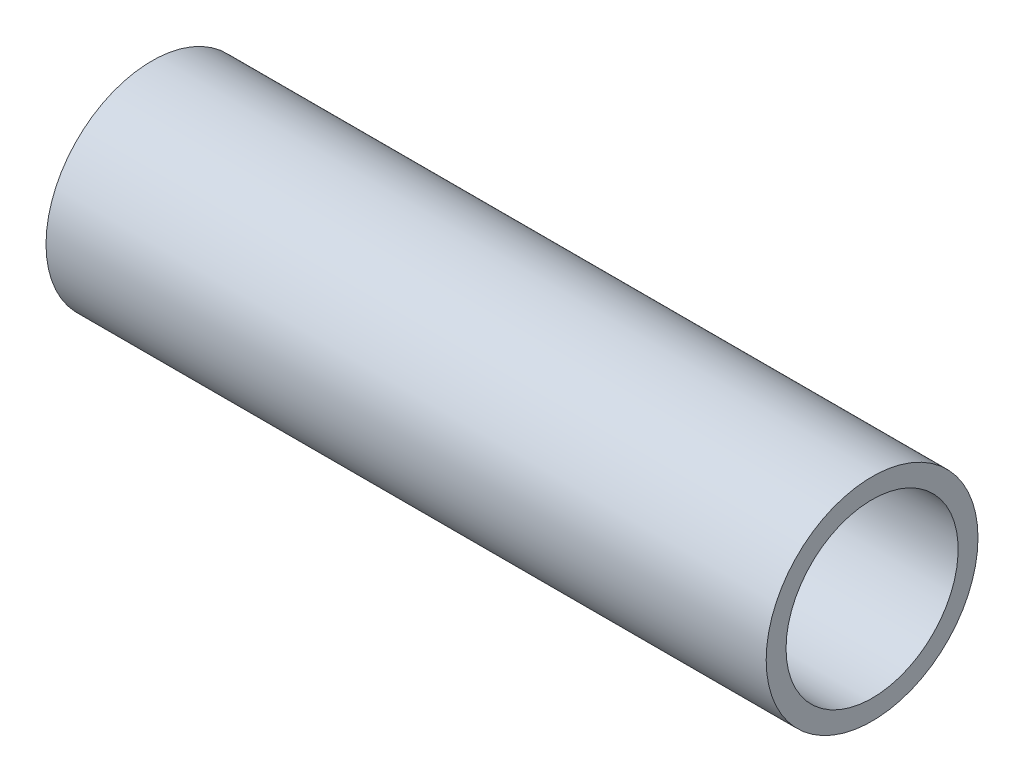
from build123d import *

# Parameters (mm, degrees)
ESQUISSE1_W = 136
ESQUISSE1_H = 3.75


with BuildPart() as part:
    # Esquisse1 → R_volution1 (revolve)
    with BuildSketch(Plane.XY, mode=Mode.PRIVATE) as r_volution1_sk:
        with Locations((170, -152.698977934)):
            Rectangle(ESQUISSE1_W, ESQUISSE1_H)
    revolve(r_volution1_sk.sketch.rotate(Axis((136.33475339, -170.823977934, 0), (1, 0, 0)), 90), axis=Axis((136.33475339, -170.823977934, 0), (1, 0, 0)))


solid = part.part
